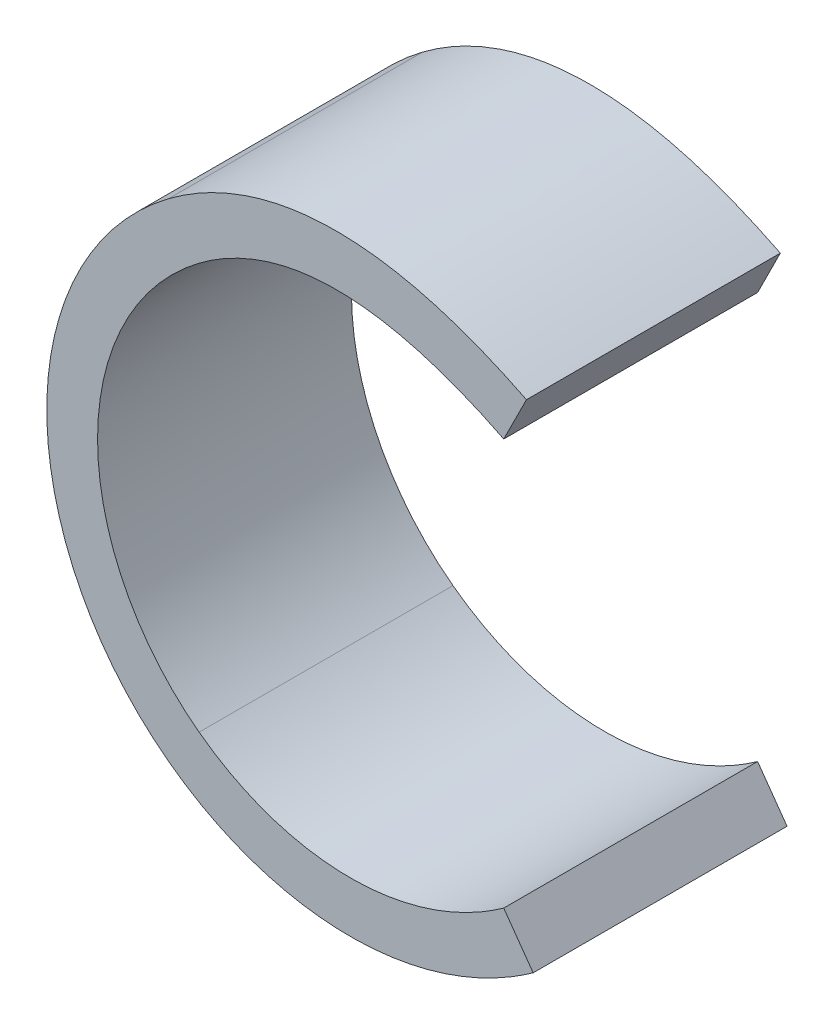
ISO-10303-21;
HEADER;
FILE_DESCRIPTION(('STEP AP214'),'2;1');
FILE_NAME('part.step','',(''),(''),'','','');
FILE_SCHEMA(('AUTOMOTIVE_DESIGN { 1 0 10303 214 1 1 1 1 }'));
ENDSEC;
DATA;
#1=APPLICATION_CONTEXT('core data for automotive mechanical design processes');
#2=APPLICATION_PROTOCOL_DEFINITION('international standard','automotive_design',2000,#1);
#3=PRODUCT_CONTEXT('',#1,'mechanical');
#4=PRODUCT('Part','Part','',(#3));
#5=PRODUCT_RELATED_PRODUCT_CATEGORY('part','',(#4));
#6=PRODUCT_DEFINITION_FORMATION('','',#4);
#7=PRODUCT_DEFINITION_CONTEXT('part definition',#1,'design');
#8=PRODUCT_DEFINITION('design','',#6,#7);
#9=PRODUCT_DEFINITION_SHAPE('','',#8);
#10=(LENGTH_UNIT() NAMED_UNIT(*) SI_UNIT(.MILLI.,.METRE.));
#11=(NAMED_UNIT(*) PLANE_ANGLE_UNIT() SI_UNIT($,.RADIAN.));
#12=(NAMED_UNIT(*) SI_UNIT($,.STERADIAN.) SOLID_ANGLE_UNIT());
#13=UNCERTAINTY_MEASURE_WITH_UNIT(LENGTH_MEASURE(1.E-05),#10,'distance_accuracy_value','');
#14=(GEOMETRIC_REPRESENTATION_CONTEXT(3) GLOBAL_UNCERTAINTY_ASSIGNED_CONTEXT((#13)) GLOBAL_UNIT_ASSIGNED_CONTEXT((#10,
#11,#12)) REPRESENTATION_CONTEXT('',''));
#15=CARTESIAN_POINT('',(0.,0.,0.));
#16=DIRECTION('',(0.,0.,1.));
#17=DIRECTION('',(1.,0.,0.));
#18=AXIS2_PLACEMENT_3D('',#15,#16,#17);
#19=CARTESIAN_POINT('',(-36.,-48.,50.));
#20=CARTESIAN_POINT('',(-31.0703804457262,-51.6972146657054,50.));
#21=CARTESIAN_POINT('',(-25.6035756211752,-54.6113596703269,50.));
#22=CARTESIAN_POINT('',(-13.987350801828,-58.6649093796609,50.));
#23=CARTESIAN_POINT('',(-7.83575402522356,-59.8038083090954,50.));
#24=CARTESIAN_POINT('',(4.73433691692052,-60.0863025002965,50.));
#25=CARTESIAN_POINT('',(11.1527368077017,-59.2268233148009,50.));
#26=CARTESIAN_POINT('',(20.6143843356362,-56.3069335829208,50.));
#27=CARTESIAN_POINT('',(23.7400449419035,-55.0625924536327,50.));
#28=CARTESIAN_POINT('',(29.8722239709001,-52.0211304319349,50.));
#29=CARTESIAN_POINT('',(32.8785979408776,-50.2240845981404,50.));
#30=CARTESIAN_POINT('',(35.7961215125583,-48.1489248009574,50.));
#31=B_SPLINE_CURVE_WITH_KNOTS('',3,(#19,#20,#21,#22,#23,#24,#25,#26,#27,#28,#29,#30),
.UNSPECIFIED.,.F.,.F.,(4,2,2,2,2,4),(0.,0.25,0.5,0.75,0.875,1.),.UNSPECIFIED.);
#32=DIRECTION('',(0.,0.,-1.));
#33=VECTOR('',#32,1.);
#34=SURFACE_OF_LINEAR_EXTRUSION('',#31,#33);
#35=CARTESIAN_POINT('',(-36.,-48.,0.));
#36=CARTESIAN_POINT('',(-31.0703804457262,-51.6972146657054,0.));
#37=CARTESIAN_POINT('',(-25.6035756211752,-54.6113596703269,0.));
#38=CARTESIAN_POINT('',(-13.987350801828,-58.6649093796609,0.));
#39=CARTESIAN_POINT('',(-7.83575402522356,-59.8038083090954,0.));
#40=CARTESIAN_POINT('',(4.73433691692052,-60.0863025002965,0.));
#41=CARTESIAN_POINT('',(11.1527368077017,-59.2268233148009,0.));
#42=CARTESIAN_POINT('',(20.6143843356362,-56.3069335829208,0.));
#43=CARTESIAN_POINT('',(23.7400449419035,-55.0625924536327,0.));
#44=CARTESIAN_POINT('',(29.8722239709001,-52.0211304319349,0.));
#45=CARTESIAN_POINT('',(32.8785979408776,-50.2240845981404,0.));
#46=CARTESIAN_POINT('',(35.7961215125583,-48.1489248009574,0.));
#47=B_SPLINE_CURVE_WITH_KNOTS('',3,(#35,#36,#37,#38,#39,#40,#41,#42,#43,#44,#45,#46),
.UNSPECIFIED.,.F.,.F.,(4,2,2,2,2,4),(0.,0.25,0.5,0.75,0.875,1.),.UNSPECIFIED.);
#48=CARTESIAN_POINT('',(-36.,-48.,0.));
#49=VERTEX_POINT('',#48);
#50=CARTESIAN_POINT('',(35.7961215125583,-48.1489248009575,0.));
#51=VERTEX_POINT('',#50);
#52=EDGE_CURVE('E193',#49,#51,#47,.T.);
#53=ORIENTED_EDGE('',*,*,#52,.T.);
#54=DIRECTION('',(0.,0.,-1.));
#55=VECTOR('',#54,1.);
#56=CARTESIAN_POINT('',(35.7961215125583,-48.1489248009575,50.));
#57=LINE('',#56,#55);
#58=CARTESIAN_POINT('',(35.7961215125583,-48.1489248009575,50.));
#59=VERTEX_POINT('',#58);
#60=EDGE_CURVE('E11',#59,#51,#57,.T.);
#61=ORIENTED_EDGE('',*,*,#60,.F.);
#62=CARTESIAN_POINT('',(-36.,-48.,50.));
#63=VERTEX_POINT('',#62);
#64=EDGE_CURVE('E88',#63,#59,#31,.T.);
#65=ORIENTED_EDGE('',*,*,#64,.F.);
#66=DIRECTION('',(0.,0.,-1.));
#67=VECTOR('',#66,1.);
#68=CARTESIAN_POINT('',(-36.,-48.,50.));
#69=LINE('',#68,#67);
#70=EDGE_CURVE('E219',#63,#49,#69,.T.);
#71=ORIENTED_EDGE('',*,*,#70,.T.);
#72=EDGE_LOOP('',(#53,#61,#65,#71));
#73=FACE_BOUND('',#72,.T.);
#74=ADVANCED_FACE('F32',(#73),#34,.F.);
#75=CARTESIAN_POINT('',(30.,-40.,50.));
#76=DIRECTION('',(0.814892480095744,0.579612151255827,0.));
#77=DIRECTION('',(-0.579612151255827,0.814892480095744,0.));
#78=AXIS2_PLACEMENT_3D('',#75,#76,#77);
#79=PLANE('',#78);
#80=DIRECTION('',(0.579612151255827,-0.814892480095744,0.));
#81=VECTOR('',#80,1.);
#82=CARTESIAN_POINT('',(30.,-40.,0.));
#83=LINE('',#82,#81);
#84=CARTESIAN_POINT('',(30.,-40.,0.));
#85=VERTEX_POINT('',#84);
#86=EDGE_CURVE('E189',#85,#51,#83,.T.);
#87=ORIENTED_EDGE('',*,*,#86,.F.);
#88=DIRECTION('',(0.,0.,-1.));
#89=VECTOR('',#88,1.);
#90=CARTESIAN_POINT('',(30.,-40.,50.));
#91=LINE('',#90,#89);
#92=CARTESIAN_POINT('',(30.,-40.,50.));
#93=VERTEX_POINT('',#92);
#94=EDGE_CURVE('E41',#93,#85,#91,.T.);
#95=ORIENTED_EDGE('',*,*,#94,.F.);
#96=DIRECTION('',(0.579612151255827,-0.814892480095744,0.));
#97=VECTOR('',#96,1.);
#98=CARTESIAN_POINT('',(30.,-40.,50.));
#99=LINE('',#98,#97);
#100=EDGE_CURVE('E165',#93,#59,#99,.T.);
#101=ORIENTED_EDGE('',*,*,#100,.T.);
#102=ORIENTED_EDGE('',*,*,#60,.T.);
#103=EDGE_LOOP('',(#87,#95,#101,#102));
#104=FACE_BOUND('',#103,.T.);
#105=ADVANCED_FACE('F157',(#104),#79,.T.);
#106=CARTESIAN_POINT('',(-30.,-40.,50.));
#107=CARTESIAN_POINT('',(-13.5679348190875,-52.3240488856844,50.));
#108=CARTESIAN_POINT('',(10.031854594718,-54.2028304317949,50.));
#109=CARTESIAN_POINT('',(30.,-40.,50.));
#110=B_SPLINE_CURVE_WITH_KNOTS('',3,(#106,#107,#108,#109),.UNSPECIFIED.,.F.,.F.,(4,4),(0.,1.),.UNSPECIFIED.);
#111=DIRECTION('',(0.,0.,-1.));
#112=VECTOR('',#111,1.);
#113=SURFACE_OF_LINEAR_EXTRUSION('',#110,#112);
#114=CARTESIAN_POINT('',(-30.,-40.,0.));
#115=CARTESIAN_POINT('',(-13.5679348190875,-52.3240488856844,0.));
#116=CARTESIAN_POINT('',(10.031854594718,-54.2028304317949,0.));
#117=CARTESIAN_POINT('',(30.,-40.,0.));
#118=B_SPLINE_CURVE_WITH_KNOTS('',3,(#114,#115,#116,#117),.UNSPECIFIED.,.F.,.F.,(4,4),(0.,1.),.UNSPECIFIED.);
#119=CARTESIAN_POINT('',(-30.,-40.,0.));
#120=VERTEX_POINT('',#119);
#121=EDGE_CURVE('E184',#120,#85,#118,.T.);
#122=ORIENTED_EDGE('',*,*,#121,.F.);
#123=DIRECTION('',(0.,0.,-1.));
#124=VECTOR('',#123,1.);
#125=CARTESIAN_POINT('',(-30.,-40.,50.));
#126=LINE('',#125,#124);
#127=CARTESIAN_POINT('',(-30.,-40.,50.));
#128=VERTEX_POINT('',#127);
#129=EDGE_CURVE('E171',#128,#120,#126,.T.);
#130=ORIENTED_EDGE('',*,*,#129,.F.);
#131=EDGE_CURVE('E159',#128,#93,#110,.T.);
#132=ORIENTED_EDGE('',*,*,#131,.T.);
#133=ORIENTED_EDGE('',*,*,#94,.T.);
#134=EDGE_LOOP('',(#122,#130,#132,#133));
#135=FACE_BOUND('',#134,.T.);
#136=ADVANCED_FACE('F153',(#135),#113,.T.);
#137=CARTESIAN_POINT('',(0.,0.,50.));
#138=DIRECTION('',(0.,0.,-1.));
#139=DIRECTION('',(-1.,0.,0.));
#140=AXIS2_PLACEMENT_3D('',#137,#138,#139);
#141=CYLINDRICAL_SURFACE('',#140,50.);
#142=CARTESIAN_POINT('',(0.,0.,0.));
#143=DIRECTION('',(0.,0.,1.));
#144=DIRECTION('',(1.,0.,0.));
#145=AXIS2_PLACEMENT_3D('',#142,#143,#144);
#146=CIRCLE('',#145,50.);
#147=CARTESIAN_POINT('',(-30.,40.,0.));
#148=VERTEX_POINT('',#147);
#149=EDGE_CURVE('E196',#148,#120,#146,.T.);
#150=ORIENTED_EDGE('',*,*,#149,.F.);
#151=DIRECTION('',(0.,0.,-1.));
#152=VECTOR('',#151,1.);
#153=CARTESIAN_POINT('',(-30.,40.,50.));
#154=LINE('',#153,#152);
#155=CARTESIAN_POINT('',(-30.,40.,50.));
#156=VERTEX_POINT('',#155);
#157=EDGE_CURVE('E173',#156,#148,#154,.T.);
#158=ORIENTED_EDGE('',*,*,#157,.F.);
#159=CARTESIAN_POINT('',(0.,0.,50.));
#160=DIRECTION('',(0.,0.,1.));
#161=DIRECTION('',(1.,0.,0.));
#162=AXIS2_PLACEMENT_3D('',#159,#160,#161);
#163=CIRCLE('',#162,50.);
#164=EDGE_CURVE('E124',#156,#128,#163,.T.);
#165=ORIENTED_EDGE('',*,*,#164,.T.);
#166=ORIENTED_EDGE('',*,*,#129,.T.);
#167=EDGE_LOOP('',(#150,#158,#165,#166));
#168=FACE_BOUND('',#167,.T.);
#169=ADVANCED_FACE('F149',(#168),#141,.F.);
#170=CARTESIAN_POINT('',(30.,40.,50.));
#171=CARTESIAN_POINT('',(6.00000000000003,52.,50.));
#172=CARTESIAN_POINT('',(-14.,52.,50.));
#173=CARTESIAN_POINT('',(-30.,40.,50.));
#174=B_SPLINE_CURVE_WITH_KNOTS('',3,(#170,#171,#172,#173),.UNSPECIFIED.,.F.,.F.,(4,4),(0.,1.),.UNSPECIFIED.);
#175=DIRECTION('',(0.,0.,-1.));
#176=VECTOR('',#175,1.);
#177=SURFACE_OF_LINEAR_EXTRUSION('',#174,#176);
#178=CARTESIAN_POINT('',(30.,40.,0.));
#179=CARTESIAN_POINT('',(6.00000000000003,52.,0.));
#180=CARTESIAN_POINT('',(-14.,52.,0.));
#181=CARTESIAN_POINT('',(-30.,40.,0.));
#182=B_SPLINE_CURVE_WITH_KNOTS('',3,(#178,#179,#180,#181),.UNSPECIFIED.,.F.,.F.,(4,4),(0.,1.),.UNSPECIFIED.);
#183=CARTESIAN_POINT('',(30.,40.,0.));
#184=VERTEX_POINT('',#183);
#185=EDGE_CURVE('E177',#184,#148,#182,.T.);
#186=ORIENTED_EDGE('',*,*,#185,.F.);
#187=DIRECTION('',(0.,0.,-1.));
#188=VECTOR('',#187,1.);
#189=CARTESIAN_POINT('',(30.,40.,50.));
#190=LINE('',#189,#188);
#191=CARTESIAN_POINT('',(30.,40.,50.));
#192=VERTEX_POINT('',#191);
#193=EDGE_CURVE('E112',#192,#184,#190,.T.);
#194=ORIENTED_EDGE('',*,*,#193,.F.);
#195=EDGE_CURVE('E122',#192,#156,#174,.T.);
#196=ORIENTED_EDGE('',*,*,#195,.T.);
#197=ORIENTED_EDGE('',*,*,#157,.T.);
#198=EDGE_LOOP('',(#186,#194,#196,#197));
#199=FACE_BOUND('',#198,.T.);
#200=ADVANCED_FACE('F146',(#199),#177,.T.);
#201=CARTESIAN_POINT('',(34.4721359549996,48.9442719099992,50.));
#202=DIRECTION('',(0.894427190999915,-0.447213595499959,0.));
#203=DIRECTION('',(0.447213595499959,0.894427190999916,0.));
#204=AXIS2_PLACEMENT_3D('',#201,#202,#203);
#205=PLANE('',#204);
#206=DIRECTION('',(-0.447213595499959,-0.894427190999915,0.));
#207=VECTOR('',#206,1.);
#208=CARTESIAN_POINT('',(34.4721359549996,48.9442719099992,0.));
#209=LINE('',#208,#207);
#210=CARTESIAN_POINT('',(34.4721359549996,48.9442719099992,0.));
#211=VERTEX_POINT('',#210);
#212=EDGE_CURVE('E111',#211,#184,#209,.T.);
#213=ORIENTED_EDGE('',*,*,#212,.F.);
#214=DIRECTION('',(0.,0.,-1.));
#215=VECTOR('',#214,1.);
#216=CARTESIAN_POINT('',(34.4721359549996,48.9442719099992,50.));
#217=LINE('',#216,#215);
#218=CARTESIAN_POINT('',(34.4721359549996,48.9442719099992,50.));
#219=VERTEX_POINT('',#218);
#220=EDGE_CURVE('E105',#219,#211,#217,.T.);
#221=ORIENTED_EDGE('',*,*,#220,.F.);
#222=DIRECTION('',(-0.447213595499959,-0.894427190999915,0.));
#223=VECTOR('',#222,1.);
#224=CARTESIAN_POINT('',(34.4721359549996,48.9442719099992,50.));
#225=LINE('',#224,#223);
#226=EDGE_CURVE('E109',#219,#192,#225,.T.);
#227=ORIENTED_EDGE('',*,*,#226,.T.);
#228=ORIENTED_EDGE('',*,*,#193,.T.);
#229=EDGE_LOOP('',(#213,#221,#227,#228));
#230=FACE_BOUND('',#229,.T.);
#231=ADVANCED_FACE('F107',(#230),#205,.T.);
#232=CARTESIAN_POINT('',(34.4721359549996,48.9442719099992,50.));
#233=CARTESIAN_POINT('',(27.9752319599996,52.1927239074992,50.));
#234=CARTESIAN_POINT('',(21.6233000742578,54.6952402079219,50.));
#235=CARTESIAN_POINT('',(12.2601110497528,57.2488372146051,50.));
#236=CARTESIAN_POINT('',(9.1666911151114,57.8991410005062,50.));
#237=CARTESIAN_POINT('',(3.03673600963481,58.7748488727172,50.));
#238=CARTESIAN_POINT('',(0.,59.,50.));
#239=CARTESIAN_POINT('',(-5.99999999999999,59.,50.));
#240=CARTESIAN_POINT('',(-8.96319980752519,58.7744337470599,50.));
#241=CARTESIAN_POINT('',(-14.781051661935,57.8558255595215,50.));
#242=CARTESIAN_POINT('',(-17.6352313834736,57.1625150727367,50.));
#243=CARTESIAN_POINT('',(-23.1893239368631,55.3111508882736,50.));
#244=CARTESIAN_POINT('',(-25.8886540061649,54.1532914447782,50.));
#245=CARTESIAN_POINT('',(-31.0941004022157,51.3974668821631,50.));
#246=CARTESIAN_POINT('',(-33.6,49.8,50.));
#247=CARTESIAN_POINT('',(-36.,48.,50.));
#248=B_SPLINE_CURVE_WITH_KNOTS('',3,(#232,#233,#234,#235,#236,#237,#238,#239,#240,#241,#242,
#243,#244,#245,#246,#247),.UNSPECIFIED.,.F.,.F.,(4,2,2,2,2,2,2,4),(0.,0.25,0.375,0.5,0.625,0.75,
0.875,1.),.UNSPECIFIED.);
#249=DIRECTION('',(0.,0.,-1.));
#250=VECTOR('',#249,1.);
#251=SURFACE_OF_LINEAR_EXTRUSION('',#248,#250);
#252=CARTESIAN_POINT('',(34.4721359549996,48.9442719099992,0.));
#253=CARTESIAN_POINT('',(27.9752319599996,52.1927239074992,0.));
#254=CARTESIAN_POINT('',(21.6233000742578,54.6952402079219,0.));
#255=CARTESIAN_POINT('',(12.2601110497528,57.2488372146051,0.));
#256=CARTESIAN_POINT('',(9.1666911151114,57.8991410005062,0.));
#257=CARTESIAN_POINT('',(3.03673600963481,58.7748488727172,0.));
#258=CARTESIAN_POINT('',(0.,59.,0.));
#259=CARTESIAN_POINT('',(-5.99999999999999,59.,0.));
#260=CARTESIAN_POINT('',(-8.96319980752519,58.7744337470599,0.));
#261=CARTESIAN_POINT('',(-14.781051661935,57.8558255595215,0.));
#262=CARTESIAN_POINT('',(-17.6352313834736,57.1625150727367,0.));
#263=CARTESIAN_POINT('',(-23.1893239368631,55.3111508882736,0.));
#264=CARTESIAN_POINT('',(-25.8886540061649,54.1532914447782,0.));
#265=CARTESIAN_POINT('',(-31.0941004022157,51.3974668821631,0.));
#266=CARTESIAN_POINT('',(-33.6,49.8,0.));
#267=CARTESIAN_POINT('',(-36.,48.,0.));
#268=B_SPLINE_CURVE_WITH_KNOTS('',3,(#252,#253,#254,#255,#256,#257,#258,#259,#260,#261,#262,
#263,#264,#265,#266,#267),.UNSPECIFIED.,.F.,.F.,(4,2,2,2,2,2,2,4),(0.,0.25,0.375,0.5,0.625,0.75,
0.875,1.),.UNSPECIFIED.);
#269=CARTESIAN_POINT('',(-36.,48.,0.));
#270=VERTEX_POINT('',#269);
#271=EDGE_CURVE('E76',#211,#270,#268,.T.);
#272=ORIENTED_EDGE('',*,*,#271,.T.);
#273=DIRECTION('',(0.,0.,-1.));
#274=VECTOR('',#273,1.);
#275=CARTESIAN_POINT('',(-36.,48.,50.));
#276=LINE('',#275,#274);
#277=CARTESIAN_POINT('',(-36.,48.,50.));
#278=VERTEX_POINT('',#277);
#279=EDGE_CURVE('E113',#278,#270,#276,.T.);
#280=ORIENTED_EDGE('',*,*,#279,.F.);
#281=EDGE_CURVE('E115',#219,#278,#248,.T.);
#282=ORIENTED_EDGE('',*,*,#281,.F.);
#283=ORIENTED_EDGE('',*,*,#220,.T.);
#284=EDGE_LOOP('',(#272,#280,#282,#283));
#285=FACE_BOUND('',#284,.T.);
#286=ADVANCED_FACE('F116',(#285),#251,.F.);
#287=CARTESIAN_POINT('',(0.,0.,50.));
#288=DIRECTION('',(0.,0.,-1.));
#289=DIRECTION('',(-1.,0.,0.));
#290=AXIS2_PLACEMENT_3D('',#287,#288,#289);
#291=CYLINDRICAL_SURFACE('',#290,60.);
#292=CARTESIAN_POINT('',(0.,0.,0.));
#293=DIRECTION('',(0.,0.,1.));
#294=DIRECTION('',(1.,0.,0.));
#295=AXIS2_PLACEMENT_3D('',#292,#293,#294);
#296=CIRCLE('',#295,60.);
#297=EDGE_CURVE('E82',#270,#49,#296,.T.);
#298=ORIENTED_EDGE('',*,*,#297,.T.);
#299=ORIENTED_EDGE('',*,*,#70,.F.);
#300=CARTESIAN_POINT('',(0.,0.,50.));
#301=DIRECTION('',(0.,0.,1.));
#302=DIRECTION('',(1.,0.,0.));
#303=AXIS2_PLACEMENT_3D('',#300,#301,#302);
#304=CIRCLE('',#303,60.);
#305=EDGE_CURVE('E49',#278,#63,#304,.T.);
#306=ORIENTED_EDGE('',*,*,#305,.F.);
#307=ORIENTED_EDGE('',*,*,#279,.T.);
#308=EDGE_LOOP('',(#298,#299,#306,#307));
#309=FACE_BOUND('',#308,.T.);
#310=ADVANCED_FACE('F142',(#309),#291,.T.);
#311=CARTESIAN_POINT('',(-1.55070855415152,-59.9450554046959,50.));
#312=DIRECTION('',(0.,0.,-1.));
#313=DIRECTION('',(-1.,0.,0.));
#314=AXIS2_PLACEMENT_3D('',#311,#312,#313);
#315=PLANE('',#314);
#316=ORIENTED_EDGE('',*,*,#64,.T.);
#317=ORIENTED_EDGE('',*,*,#100,.F.);
#318=ORIENTED_EDGE('',*,*,#131,.F.);
#319=ORIENTED_EDGE('',*,*,#164,.F.);
#320=ORIENTED_EDGE('',*,*,#195,.F.);
#321=ORIENTED_EDGE('',*,*,#226,.F.);
#322=ORIENTED_EDGE('',*,*,#281,.T.);
#323=ORIENTED_EDGE('',*,*,#305,.T.);
#324=EDGE_LOOP('',(#316,#317,#318,#319,#320,#321,#322,#323));
#325=FACE_BOUND('',#324,.T.);
#326=ADVANCED_FACE('F119',(#325),#315,.F.);
#327=CARTESIAN_POINT('',(-1.55070855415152,-59.9450554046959,0.));
#328=DIRECTION('',(0.,0.,-1.));
#329=DIRECTION('',(-1.,0.,0.));
#330=AXIS2_PLACEMENT_3D('',#327,#328,#329);
#331=PLANE('',#330);
#332=ORIENTED_EDGE('',*,*,#52,.F.);
#333=ORIENTED_EDGE('',*,*,#297,.F.);
#334=ORIENTED_EDGE('',*,*,#271,.F.);
#335=ORIENTED_EDGE('',*,*,#212,.T.);
#336=ORIENTED_EDGE('',*,*,#185,.T.);
#337=ORIENTED_EDGE('',*,*,#149,.T.);
#338=ORIENTED_EDGE('',*,*,#121,.T.);
#339=ORIENTED_EDGE('',*,*,#86,.T.);
#340=EDGE_LOOP('',(#332,#333,#334,#335,#336,#337,#338,#339));
#341=FACE_BOUND('',#340,.T.);
#342=ADVANCED_FACE('F195',(#341),#331,.T.);
#343=CLOSED_SHELL('',(#74,#105,#136,#169,#200,#231,#286,#310,#326,#342));
#344=MANIFOLD_SOLID_BREP('B2',#343);
#345=ADVANCED_BREP_SHAPE_REPRESENTATION('',(#18,#344),#14);
#346=SHAPE_DEFINITION_REPRESENTATION(#9,#345);
ENDSEC;
END-ISO-10303-21;
